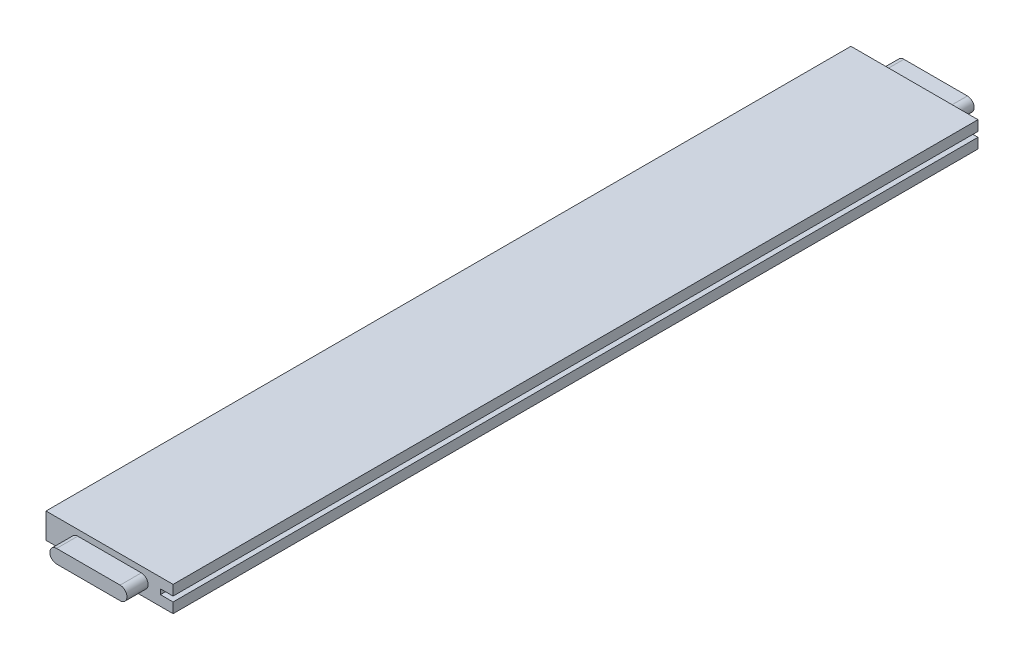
from build123d import *

# Parameters (mm, degrees)
CROQUIS1_W                      = 170
CROQUIS1_H                      = 35
EXTRUIR1_DEPTH                  = 525
CEPILLADO_REGRUESADO_DEPTH      = 533.124280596
CEPILLADO_REGRUESADO_DEPTH_BACK = 533.124280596
CROQUIS2_W                      = 150
CROQUIS2_H                      = 30
CROQUIS3_W                      = 150
CROQUIS3_H                      = 25
LARGO_CORTE_DEPTH               = 532.177936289
CROQUIS5_W                      = 15
CROQUIS5_H                      = 6
RANURADO_TUP_DEPTH              = 1003.920734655
ESPIGA_DEPTH                    = 25


with BuildPart() as part:
    # Croquis1 → Extruir1 (new, symmetric)
    with BuildSketch(Plane.XY):
        Rectangle(CROQUIS1_W, CROQUIS1_H)
    extrude(amount=EXTRUIR1_DEPTH, both=True)

    # Croquis2 → Cepillado -Regruesado (cut, two sides: drawn at the far end of the back side and taken through both)
    with BuildSketch(Plane.XY.offset(-CEPILLADO_REGRUESADO_DEPTH_BACK)):
        Polygon((-85, 17.5), (85, 17.5), (85, 10), (85, -10), (85, -17.5), (-85, -17.5), (-85, -10), (-85, 10), align=None)
        Rectangle(CROQUIS2_W, CROQUIS2_H, mode=Mode.SUBTRACT)
    extrude(amount=CEPILLADO_REGRUESADO_DEPTH + CEPILLADO_REGRUESADO_DEPTH_BACK, mode=Mode.SUBTRACT)

    # Croquis3 → Largo - Corte (cut, through all)
    with BuildSketch(Plane(origin=(0, 15, 0), x_dir=(1, 0, 0), z_dir=(0, 1, 0))):
        with Locations((0, 512.5)):
            Rectangle(CROQUIS3_W, CROQUIS3_H)
        with Locations((0, -512.5)):
            Rectangle(CROQUIS3_W, CROQUIS3_H)
    extrude(amount=-LARGO_CORTE_DEPTH, mode=Mode.SUBTRACT)

    # Croquis5 → Ranurado - Tup (cut, through all)
    with BuildSketch(Plane(origin=(0, 0, -500), x_dir=(-1, 0, 0), z_dir=(0, 0, -1))):
        with Locations((-67.5, 0)):
            Rectangle(CROQUIS5_W, CROQUIS5_H)
    extrude(amount=-RANURADO_TUP_DEPTH, mode=Mode.SUBTRACT)

    # Croquis4 → Espiga (cut)
    with BuildSketch(Plane.XY.offset(500)):
        Polygon((75, 15), (-75, 15), (-75, -15), (75, -15), (75, -3), (60, -3), (60, 3), (75, 3), align=None)
        with BuildLine():
            Line((-37.5, 8), (37.5, 8))
            ThreePointArc((37.5, 8), (45.5, 0), (37.5, -8))
            Line((37.5, -8), (-37.5, -8))
            ThreePointArc((-37.5, -8), (-45.5, 0), (-37.5, 8))
        make_face(mode=Mode.SUBTRACT)
    espiga = extrude(amount=-ESPIGA_DEPTH, mode=Mode.SUBTRACT)

    # Simetr_a1: Espiga across plane
    add(espiga.mirror(Plane.XY), mode=Mode.SUBTRACT)


solid = part.part
